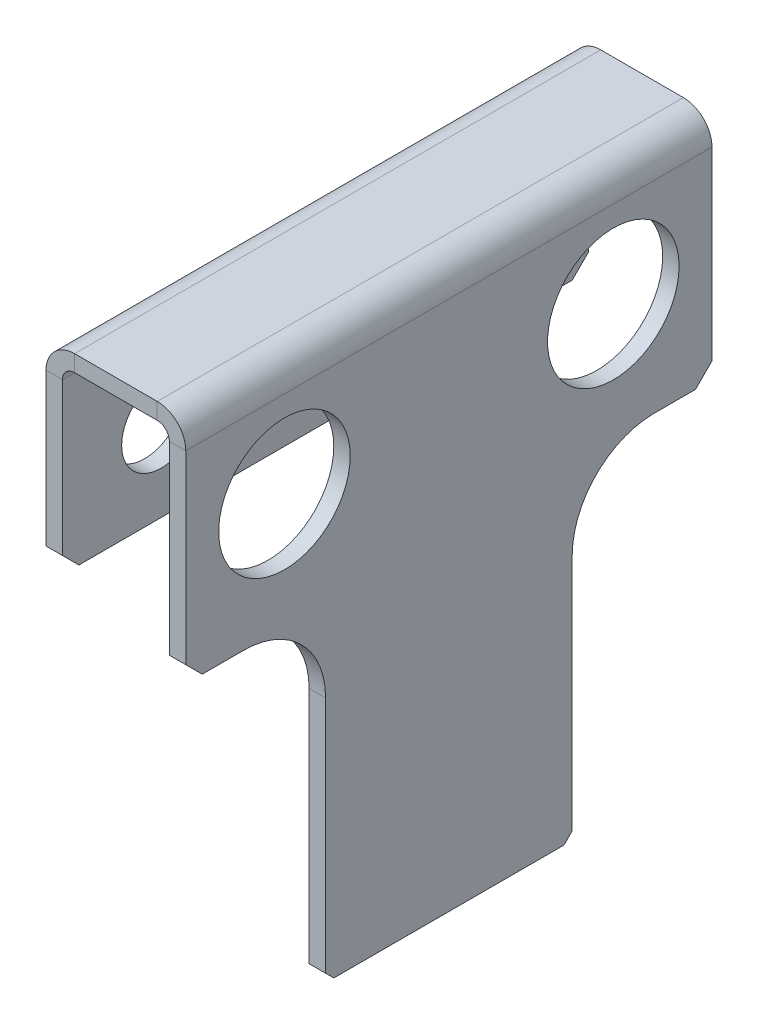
ISO-10303-21;
HEADER;
FILE_DESCRIPTION(('STEP AP214'),'2;1');
FILE_NAME('part.step','',(''),(''),'','','');
FILE_SCHEMA(('AUTOMOTIVE_DESIGN { 1 0 10303 214 1 1 1 1 }'));
ENDSEC;
DATA;
#1=APPLICATION_CONTEXT('core data for automotive mechanical design processes');
#2=APPLICATION_PROTOCOL_DEFINITION('international standard','automotive_design',2000,#1);
#3=PRODUCT_CONTEXT('',#1,'mechanical');
#4=PRODUCT('Part','Part','',(#3));
#5=PRODUCT_RELATED_PRODUCT_CATEGORY('part','',(#4));
#6=PRODUCT_DEFINITION_FORMATION('','',#4);
#7=PRODUCT_DEFINITION_CONTEXT('part definition',#1,'design');
#8=PRODUCT_DEFINITION('design','',#6,#7);
#9=PRODUCT_DEFINITION_SHAPE('','',#8);
#10=(LENGTH_UNIT() NAMED_UNIT(*) SI_UNIT(.MILLI.,.METRE.));
#11=(NAMED_UNIT(*) PLANE_ANGLE_UNIT() SI_UNIT($,.RADIAN.));
#12=(NAMED_UNIT(*) SI_UNIT($,.STERADIAN.) SOLID_ANGLE_UNIT());
#13=UNCERTAINTY_MEASURE_WITH_UNIT(LENGTH_MEASURE(1.E-05),#10,'distance_accuracy_value','');
#14=(GEOMETRIC_REPRESENTATION_CONTEXT(3) GLOBAL_UNCERTAINTY_ASSIGNED_CONTEXT((#13)) GLOBAL_UNIT_ASSIGNED_CONTEXT((#10,
#11,#12)) REPRESENTATION_CONTEXT('',''));
#15=CARTESIAN_POINT('',(0.,0.,0.));
#16=DIRECTION('',(0.,0.,1.));
#17=DIRECTION('',(1.,0.,0.));
#18=AXIS2_PLACEMENT_3D('',#15,#16,#17);
#19=CARTESIAN_POINT('',(1.7366,12.,16.));
#20=DIRECTION('',(0.,0.,1.));
#21=DIRECTION('',(1.,0.,0.));
#22=AXIS2_PLACEMENT_3D('',#19,#20,#21);
#23=PLANE('',#22);
#24=DIRECTION('',(0.,-1.,0.));
#25=VECTOR('',#24,1.);
#26=CARTESIAN_POINT('',(1.7366,12.,16.));
#27=LINE('',#26,#25);
#28=CARTESIAN_POINT('',(1.7366,12.,16.));
#29=VERTEX_POINT('',#28);
#30=CARTESIAN_POINT('',(1.7366,11.,16.));
#31=VERTEX_POINT('',#30);
#32=EDGE_CURVE('E327',#29,#31,#27,.T.);
#33=ORIENTED_EDGE('',*,*,#32,.F.);
#34=CARTESIAN_POINT('',(1.7366,10.2634,16.));
#35=DIRECTION('',(0.,0.,1.));
#36=DIRECTION('',(1.,0.,0.));
#37=AXIS2_PLACEMENT_3D('',#34,#35,#36);
#38=CIRCLE('',#37,1.7366);
#39=CARTESIAN_POINT('',(0.,10.2634,16.));
#40=VERTEX_POINT('',#39);
#41=EDGE_CURVE('E244',#40,#29,#38,.F.);
#42=ORIENTED_EDGE('',*,*,#41,.F.);
#43=DIRECTION('',(-1.,0.,0.));
#44=VECTOR('',#43,1.);
#45=CARTESIAN_POINT('',(1.,10.2634,16.));
#46=LINE('',#45,#44);
#47=CARTESIAN_POINT('',(1.,10.2634,16.));
#48=VERTEX_POINT('',#47);
#49=EDGE_CURVE('E324',#48,#40,#46,.T.);
#50=ORIENTED_EDGE('',*,*,#49,.F.);
#51=CARTESIAN_POINT('',(1.7366,10.2634,16.));
#52=DIRECTION('',(0.,0.,1.));
#53=DIRECTION('',(1.,0.,0.));
#54=AXIS2_PLACEMENT_3D('',#51,#52,#53);
#55=CIRCLE('',#54,0.7366);
#56=EDGE_CURVE('E254',#48,#31,#55,.F.);
#57=ORIENTED_EDGE('',*,*,#56,.T.);
#58=EDGE_LOOP('',(#33,#42,#50,#57));
#59=FACE_BOUND('',#58,.T.);
#60=ADVANCED_FACE('F40',(#59),#23,.T.);
#61=CARTESIAN_POINT('',(1.,10.2634,16.));
#62=DIRECTION('',(0.,0.,1.));
#63=DIRECTION('',(1.,0.,0.));
#64=AXIS2_PLACEMENT_3D('',#61,#62,#63);
#65=PLANE('',#64);
#66=DIRECTION('',(1.,0.,0.));
#67=VECTOR('',#66,1.);
#68=CARTESIAN_POINT('',(0.,12.,16.));
#69=LINE('',#68,#67);
#70=CARTESIAN_POINT('',(6.7634,12.,16.));
#71=VERTEX_POINT('',#70);
#72=EDGE_CURVE('E242',#29,#71,#69,.T.);
#73=ORIENTED_EDGE('',*,*,#72,.F.);
#74=ORIENTED_EDGE('',*,*,#32,.T.);
#75=DIRECTION('',(1.,0.,0.));
#76=VECTOR('',#75,1.);
#77=CARTESIAN_POINT('',(0.,11.,16.));
#78=LINE('',#77,#76);
#79=CARTESIAN_POINT('',(6.7634,11.,16.));
#80=VERTEX_POINT('',#79);
#81=EDGE_CURVE('E257',#31,#80,#78,.T.);
#82=ORIENTED_EDGE('',*,*,#81,.T.);
#83=DIRECTION('',(0.,1.,0.));
#84=VECTOR('',#83,1.);
#85=CARTESIAN_POINT('',(6.7634,11.,16.));
#86=LINE('',#85,#84);
#87=EDGE_CURVE('E215',#80,#71,#86,.T.);
#88=ORIENTED_EDGE('',*,*,#87,.T.);
#89=EDGE_LOOP('',(#73,#74,#82,#88));
#90=FACE_BOUND('',#89,.T.);
#91=ADVANCED_FACE('F432',(#90),#65,.T.);
#92=CARTESIAN_POINT('',(0.,10.2634,-16.));
#93=DIRECTION('',(0.,0.,-1.));
#94=DIRECTION('',(-1.,0.,0.));
#95=AXIS2_PLACEMENT_3D('',#92,#93,#94);
#96=PLANE('',#95);
#97=DIRECTION('',(1.,0.,0.));
#98=VECTOR('',#97,1.);
#99=CARTESIAN_POINT('',(0.,10.2634,-16.));
#100=LINE('',#99,#98);
#101=CARTESIAN_POINT('',(0.,10.2634,-16.));
#102=VERTEX_POINT('',#101);
#103=CARTESIAN_POINT('',(1.,10.2634,-16.));
#104=VERTEX_POINT('',#103);
#105=EDGE_CURVE('E321',#102,#104,#100,.T.);
#106=ORIENTED_EDGE('',*,*,#105,.F.);
#107=CARTESIAN_POINT('',(1.7366,10.2634,-16.));
#108=DIRECTION('',(0.,0.,1.));
#109=DIRECTION('',(1.,0.,0.));
#110=AXIS2_PLACEMENT_3D('',#107,#108,#109);
#111=CIRCLE('',#110,1.7366);
#112=CARTESIAN_POINT('',(1.7366,12.,-16.));
#113=VERTEX_POINT('',#112);
#114=EDGE_CURVE('E272',#102,#113,#111,.F.);
#115=ORIENTED_EDGE('',*,*,#114,.T.);
#116=DIRECTION('',(0.,1.,0.));
#117=VECTOR('',#116,1.);
#118=CARTESIAN_POINT('',(1.7366,11.,-16.));
#119=LINE('',#118,#117);
#120=CARTESIAN_POINT('',(1.7366,11.,-16.));
#121=VERTEX_POINT('',#120);
#122=EDGE_CURVE('E214',#121,#113,#119,.T.);
#123=ORIENTED_EDGE('',*,*,#122,.F.);
#124=CARTESIAN_POINT('',(1.7366,10.2634,-16.));
#125=DIRECTION('',(0.,0.,1.));
#126=DIRECTION('',(1.,0.,0.));
#127=AXIS2_PLACEMENT_3D('',#124,#125,#126);
#128=CIRCLE('',#127,0.7366);
#129=EDGE_CURVE('E279',#104,#121,#128,.F.);
#130=ORIENTED_EDGE('',*,*,#129,.F.);
#131=EDGE_LOOP('',(#106,#115,#123,#130));
#132=FACE_BOUND('',#131,.T.);
#133=ADVANCED_FACE('F527',(#132),#96,.T.);
#134=CARTESIAN_POINT('',(1.7366,11.,-16.));
#135=DIRECTION('',(0.,0.,-1.));
#136=DIRECTION('',(-1.,0.,0.));
#137=AXIS2_PLACEMENT_3D('',#134,#135,#136);
#138=PLANE('',#137);
#139=DIRECTION('',(0.,1.,0.));
#140=VECTOR('',#139,1.);
#141=CARTESIAN_POINT('',(1.,0.,-16.));
#142=LINE('',#141,#140);
#143=CARTESIAN_POINT('',(1.,1.00000000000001,-16.));
#144=VERTEX_POINT('',#143);
#145=EDGE_CURVE('E277',#144,#104,#142,.T.);
#146=ORIENTED_EDGE('',*,*,#145,.F.);
#147=DIRECTION('',(-1.,0.,0.));
#148=VECTOR('',#147,1.);
#149=CARTESIAN_POINT('',(1.7366,1.00000000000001,-16.));
#150=LINE('',#149,#148);
#151=CARTESIAN_POINT('',(0.,1.00000000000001,-16.));
#152=VERTEX_POINT('',#151);
#153=EDGE_CURVE('E385',#144,#152,#150,.T.);
#154=ORIENTED_EDGE('',*,*,#153,.T.);
#155=DIRECTION('',(0.,1.,0.));
#156=VECTOR('',#155,1.);
#157=CARTESIAN_POINT('',(0.,0.,-16.));
#158=LINE('',#157,#156);
#159=EDGE_CURVE('E275',#152,#102,#158,.T.);
#160=ORIENTED_EDGE('',*,*,#159,.T.);
#161=ORIENTED_EDGE('',*,*,#105,.T.);
#162=EDGE_LOOP('',(#146,#154,#160,#161));
#163=FACE_BOUND('',#162,.T.);
#164=ADVANCED_FACE('F405',(#163),#138,.T.);
#165=CARTESIAN_POINT('',(8.5,10.2634,16.));
#166=DIRECTION('',(0.,0.,1.));
#167=DIRECTION('',(1.,0.,0.));
#168=AXIS2_PLACEMENT_3D('',#165,#166,#167);
#169=PLANE('',#168);
#170=DIRECTION('',(-1.,0.,0.));
#171=VECTOR('',#170,1.);
#172=CARTESIAN_POINT('',(8.5,10.2634,16.));
#173=LINE('',#172,#171);
#174=CARTESIAN_POINT('',(8.5,10.2634,16.));
#175=VERTEX_POINT('',#174);
#176=CARTESIAN_POINT('',(7.5,10.2634,16.));
#177=VERTEX_POINT('',#176);
#178=EDGE_CURVE('E202',#175,#177,#173,.T.);
#179=ORIENTED_EDGE('',*,*,#178,.F.);
#180=CARTESIAN_POINT('',(6.7634,10.2634,16.));
#181=DIRECTION('',(0.,0.,1.));
#182=DIRECTION('',(1.,0.,0.));
#183=AXIS2_PLACEMENT_3D('',#180,#181,#182);
#184=CIRCLE('',#183,1.7366);
#185=EDGE_CURVE('E206',#71,#175,#184,.F.);
#186=ORIENTED_EDGE('',*,*,#185,.F.);
#187=ORIENTED_EDGE('',*,*,#87,.F.);
#188=CARTESIAN_POINT('',(6.7634,10.2634,16.));
#189=DIRECTION('',(0.,0.,1.));
#190=DIRECTION('',(1.,0.,0.));
#191=AXIS2_PLACEMENT_3D('',#188,#189,#190);
#192=CIRCLE('',#191,0.7366);
#193=EDGE_CURVE('E209',#80,#177,#192,.F.);
#194=ORIENTED_EDGE('',*,*,#193,.T.);
#195=EDGE_LOOP('',(#179,#186,#187,#194));
#196=FACE_BOUND('',#195,.T.);
#197=ADVANCED_FACE('F204',(#196),#169,.T.);
#198=CARTESIAN_POINT('',(6.7634,11.,16.));
#199=DIRECTION('',(0.,0.,1.));
#200=DIRECTION('',(1.,0.,0.));
#201=AXIS2_PLACEMENT_3D('',#198,#199,#200);
#202=PLANE('',#201);
#203=DIRECTION('',(0.,-1.,0.));
#204=VECTOR('',#203,1.);
#205=CARTESIAN_POINT('',(7.5,12.,16.));
#206=LINE('',#205,#204);
#207=CARTESIAN_POINT('',(7.5,-0.999999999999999,16.));
#208=VERTEX_POINT('',#207);
#209=EDGE_CURVE('E237',#177,#208,#206,.T.);
#210=ORIENTED_EDGE('',*,*,#209,.T.);
#211=DIRECTION('',(1.,0.,0.));
#212=VECTOR('',#211,1.);
#213=CARTESIAN_POINT('',(8.5,-0.999999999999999,16.));
#214=LINE('',#213,#212);
#215=CARTESIAN_POINT('',(8.5,-0.999999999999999,16.));
#216=VERTEX_POINT('',#215);
#217=EDGE_CURVE('E236',#208,#216,#214,.T.);
#218=ORIENTED_EDGE('',*,*,#217,.T.);
#219=DIRECTION('',(0.,-1.,0.));
#220=VECTOR('',#219,1.);
#221=CARTESIAN_POINT('',(8.5,12.,16.));
#222=LINE('',#221,#220);
#223=EDGE_CURVE('E224',#175,#216,#222,.T.);
#224=ORIENTED_EDGE('',*,*,#223,.F.);
#225=ORIENTED_EDGE('',*,*,#178,.T.);
#226=EDGE_LOOP('',(#210,#218,#224,#225));
#227=FACE_BOUND('',#226,.T.);
#228=ADVANCED_FACE('F234',(#227),#202,.T.);
#229=CARTESIAN_POINT('',(6.7634,12.,-16.));
#230=DIRECTION('',(0.,0.,-1.));
#231=DIRECTION('',(-1.,0.,0.));
#232=AXIS2_PLACEMENT_3D('',#229,#230,#231);
#233=PLANE('',#232);
#234=DIRECTION('',(0.,-1.,0.));
#235=VECTOR('',#234,1.);
#236=CARTESIAN_POINT('',(6.7634,12.,-16.));
#237=LINE('',#236,#235);
#238=CARTESIAN_POINT('',(6.7634,12.,-16.));
#239=VERTEX_POINT('',#238);
#240=CARTESIAN_POINT('',(6.7634,11.,-16.));
#241=VERTEX_POINT('',#240);
#242=EDGE_CURVE('E317',#239,#241,#237,.T.);
#243=ORIENTED_EDGE('',*,*,#242,.F.);
#244=CARTESIAN_POINT('',(6.7634,10.2634,-16.));
#245=DIRECTION('',(0.,0.,1.));
#246=DIRECTION('',(1.,0.,0.));
#247=AXIS2_PLACEMENT_3D('',#244,#245,#246);
#248=CIRCLE('',#247,1.7366);
#249=CARTESIAN_POINT('',(8.5,10.2634,-16.));
#250=VERTEX_POINT('',#249);
#251=EDGE_CURVE('E267',#239,#250,#248,.F.);
#252=ORIENTED_EDGE('',*,*,#251,.T.);
#253=DIRECTION('',(1.,0.,0.));
#254=VECTOR('',#253,1.);
#255=CARTESIAN_POINT('',(7.5,10.2634,-16.));
#256=LINE('',#255,#254);
#257=CARTESIAN_POINT('',(7.5,10.2634,-16.));
#258=VERTEX_POINT('',#257);
#259=EDGE_CURVE('E315',#258,#250,#256,.T.);
#260=ORIENTED_EDGE('',*,*,#259,.F.);
#261=CARTESIAN_POINT('',(6.7634,10.2634,-16.));
#262=DIRECTION('',(0.,0.,1.));
#263=DIRECTION('',(1.,0.,0.));
#264=AXIS2_PLACEMENT_3D('',#261,#262,#263);
#265=CIRCLE('',#264,0.7366);
#266=EDGE_CURVE('E285',#241,#258,#265,.F.);
#267=ORIENTED_EDGE('',*,*,#266,.F.);
#268=EDGE_LOOP('',(#243,#252,#260,#267));
#269=FACE_BOUND('',#268,.T.);
#270=ADVANCED_FACE('F519',(#269),#233,.T.);
#271=CARTESIAN_POINT('',(7.5,10.2634,-16.));
#272=DIRECTION('',(0.,0.,-1.));
#273=DIRECTION('',(-1.,0.,0.));
#274=AXIS2_PLACEMENT_3D('',#271,#272,#273);
#275=PLANE('',#274);
#276=DIRECTION('',(1.,0.,0.));
#277=VECTOR('',#276,1.);
#278=CARTESIAN_POINT('',(0.,12.,-16.));
#279=LINE('',#278,#277);
#280=EDGE_CURVE('E269',#113,#239,#279,.T.);
#281=ORIENTED_EDGE('',*,*,#280,.T.);
#282=ORIENTED_EDGE('',*,*,#242,.T.);
#283=DIRECTION('',(1.,0.,0.));
#284=VECTOR('',#283,1.);
#285=CARTESIAN_POINT('',(0.,11.,-16.));
#286=LINE('',#285,#284);
#287=EDGE_CURVE('E282',#121,#241,#286,.T.);
#288=ORIENTED_EDGE('',*,*,#287,.F.);
#289=ORIENTED_EDGE('',*,*,#122,.T.);
#290=EDGE_LOOP('',(#281,#282,#288,#289));
#291=FACE_BOUND('',#290,.T.);
#292=ADVANCED_FACE('F510',(#291),#275,.T.);
#293=CARTESIAN_POINT('',(7.5,12.,16.));
#294=DIRECTION('',(1.,0.,0.));
#295=DIRECTION('',(0.,1.,0.));
#296=AXIS2_PLACEMENT_3D('',#293,#294,#295);
#297=PLANE('',#296);
#298=CARTESIAN_POINT('',(7.5,5.,10.));
#299=DIRECTION('',(1.,0.,0.));
#300=DIRECTION('',(0.,1.,0.));
#301=AXIS2_PLACEMENT_3D('',#298,#299,#300);
#302=CIRCLE('',#301,3.99999999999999);
#303=CARTESIAN_POINT('',(7.5,9.,10.));
#304=VERTEX_POINT('',#303);
#305=EDGE_CURVE('E479',#304,#304,#302,.T.);
#306=ORIENTED_EDGE('',*,*,#305,.T.);
#307=EDGE_LOOP('',(#306));
#308=FACE_BOUND('',#307,.T.);
#309=CARTESIAN_POINT('',(7.5,5.,-10.));
#310=DIRECTION('',(1.,0.,0.));
#311=DIRECTION('',(0.,1.,0.));
#312=AXIS2_PLACEMENT_3D('',#309,#310,#311);
#313=CIRCLE('',#312,3.99999999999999);
#314=CARTESIAN_POINT('',(7.5,9.,-10.));
#315=VERTEX_POINT('',#314);
#316=EDGE_CURVE('E470',#315,#315,#313,.T.);
#317=ORIENTED_EDGE('',*,*,#316,.T.);
#318=EDGE_LOOP('',(#317));
#319=FACE_BOUND('',#318,.T.);
#320=DIRECTION('',(0.,0.,-1.));
#321=VECTOR('',#320,1.);
#322=CARTESIAN_POINT('',(7.50000000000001,-22.,16.));
#323=LINE('',#322,#321);
#324=CARTESIAN_POINT('',(7.50000000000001,-22.,6.99999999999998));
#325=VERTEX_POINT('',#324);
#326=CARTESIAN_POINT('',(7.50000000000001,-22.,-6.99999999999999));
#327=VERTEX_POINT('',#326);
#328=EDGE_CURVE('E312',#325,#327,#323,.T.);
#329=ORIENTED_EDGE('',*,*,#328,.F.);
#330=DIRECTION('',(0.,0.707106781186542,0.707106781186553));
#331=VECTOR('',#330,1.);
#332=CARTESIAN_POINT('',(7.50000000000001,-21.5,7.5));
#333=LINE('',#332,#331);
#334=CARTESIAN_POINT('',(7.50000000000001,-21.5,7.5));
#335=VERTEX_POINT('',#334);
#336=EDGE_CURVE('E381',#325,#335,#333,.T.);
#337=ORIENTED_EDGE('',*,*,#336,.T.);
#338=DIRECTION('',(0.,1.,0.));
#339=VECTOR('',#338,1.);
#340=CARTESIAN_POINT('',(7.5,12.,7.49999999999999));
#341=LINE('',#340,#339);
#342=CARTESIAN_POINT('',(7.5,-7.,7.5));
#343=VERTEX_POINT('',#342);
#344=EDGE_CURVE('E450',#335,#343,#341,.T.);
#345=ORIENTED_EDGE('',*,*,#344,.T.);
#346=CARTESIAN_POINT('',(7.5,-7.,12.5));
#347=DIRECTION('',(1.,0.,0.));
#348=DIRECTION('',(0.,1.,0.));
#349=AXIS2_PLACEMENT_3D('',#346,#347,#348);
#350=CIRCLE('',#349,5.);
#351=CARTESIAN_POINT('',(7.5,-2.,12.5));
#352=VERTEX_POINT('',#351);
#353=EDGE_CURVE('E349',#343,#352,#350,.T.);
#354=ORIENTED_EDGE('',*,*,#353,.T.);
#355=DIRECTION('',(0.,0.,1.));
#356=VECTOR('',#355,1.);
#357=CARTESIAN_POINT('',(7.5,-2.,16.));
#358=LINE('',#357,#356);
#359=CARTESIAN_POINT('',(7.5,-2.,15.));
#360=VERTEX_POINT('',#359);
#361=EDGE_CURVE('E265',#352,#360,#358,.T.);
#362=ORIENTED_EDGE('',*,*,#361,.T.);
#363=DIRECTION('',(0.,0.707106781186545,0.70710678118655));
#364=VECTOR('',#363,1.);
#365=CARTESIAN_POINT('',(7.5,-0.999999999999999,16.));
#366=LINE('',#365,#364);
#367=EDGE_CURVE('E354',#360,#208,#366,.T.);
#368=ORIENTED_EDGE('',*,*,#367,.T.);
#369=ORIENTED_EDGE('',*,*,#209,.F.);
#370=DIRECTION('',(0.,0.,-1.));
#371=VECTOR('',#370,1.);
#372=CARTESIAN_POINT('',(7.5,10.2634,16.));
#373=LINE('',#372,#371);
#374=EDGE_CURVE('E261',#177,#258,#373,.T.);
#375=ORIENTED_EDGE('',*,*,#374,.T.);
#376=DIRECTION('',(0.,-1.,0.));
#377=VECTOR('',#376,1.);
#378=CARTESIAN_POINT('',(7.5,12.,-16.));
#379=LINE('',#378,#377);
#380=CARTESIAN_POINT('',(7.5,-0.999999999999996,-16.));
#381=VERTEX_POINT('',#380);
#382=EDGE_CURVE('E262',#258,#381,#379,.T.);
#383=ORIENTED_EDGE('',*,*,#382,.T.);
#384=DIRECTION('',(0.,0.707106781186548,-0.707106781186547));
#385=VECTOR('',#384,1.);
#386=CARTESIAN_POINT('',(7.5,-0.999999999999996,-16.));
#387=LINE('',#386,#385);
#388=CARTESIAN_POINT('',(7.5,-2.,-15.));
#389=VERTEX_POINT('',#388);
#390=EDGE_CURVE('E356',#381,#389,#387,.F.);
#391=ORIENTED_EDGE('',*,*,#390,.T.);
#392=DIRECTION('',(0.,0.,1.));
#393=VECTOR('',#392,1.);
#394=CARTESIAN_POINT('',(7.5,-1.99999999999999,16.));
#395=LINE('',#394,#393);
#396=CARTESIAN_POINT('',(7.5,-2.,-12.5));
#397=VERTEX_POINT('',#396);
#398=EDGE_CURVE('E460',#389,#397,#395,.T.);
#399=ORIENTED_EDGE('',*,*,#398,.T.);
#400=CARTESIAN_POINT('',(7.5,-7.,-12.5));
#401=DIRECTION('',(1.,0.,0.));
#402=DIRECTION('',(0.,1.,0.));
#403=AXIS2_PLACEMENT_3D('',#400,#401,#402);
#404=CIRCLE('',#403,5.);
#405=CARTESIAN_POINT('',(7.5,-7.,-7.5));
#406=VERTEX_POINT('',#405);
#407=EDGE_CURVE('E344',#397,#406,#404,.T.);
#408=ORIENTED_EDGE('',*,*,#407,.T.);
#409=DIRECTION('',(0.,-1.,0.));
#410=VECTOR('',#409,1.);
#411=CARTESIAN_POINT('',(7.5,12.,-7.49999999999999));
#412=LINE('',#411,#410);
#413=CARTESIAN_POINT('',(7.50000000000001,-21.5,-7.5));
#414=VERTEX_POINT('',#413);
#415=EDGE_CURVE('E457',#406,#414,#412,.T.);
#416=ORIENTED_EDGE('',*,*,#415,.T.);
#417=DIRECTION('',(0.,-0.707106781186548,0.707106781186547));
#418=VECTOR('',#417,1.);
#419=CARTESIAN_POINT('',(7.50000000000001,-22.,-6.99999999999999));
#420=LINE('',#419,#418);
#421=EDGE_CURVE('E379',#414,#327,#420,.T.);
#422=ORIENTED_EDGE('',*,*,#421,.T.);
#423=EDGE_LOOP('',(#329,#337,#345,#354,#362,#368,#369,#375,#383,#391,#399,#408,#416,#422));
#424=FACE_BOUND('',#423,.T.);
#425=ADVANCED_FACE('F445',(#308,#319,#424),#297,.F.);
#426=CARTESIAN_POINT('',(8.50000000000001,-22.,16.));
#427=DIRECTION('',(0.,-1.,0.));
#428=DIRECTION('',(0.,0.,-1.));
#429=AXIS2_PLACEMENT_3D('',#426,#427,#428);
#430=PLANE('',#429);
#431=DIRECTION('',(0.,0.,-1.));
#432=VECTOR('',#431,1.);
#433=CARTESIAN_POINT('',(8.50000000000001,-22.,16.));
#434=LINE('',#433,#432);
#435=CARTESIAN_POINT('',(8.50000000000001,-22.,6.99999999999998));
#436=VERTEX_POINT('',#435);
#437=CARTESIAN_POINT('',(8.50000000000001,-22.,-6.99999999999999));
#438=VERTEX_POINT('',#437);
#439=EDGE_CURVE('E230',#436,#438,#434,.T.);
#440=ORIENTED_EDGE('',*,*,#439,.F.);
#441=DIRECTION('',(-1.,0.,0.));
#442=VECTOR('',#441,1.);
#443=CARTESIAN_POINT('',(7.50000000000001,-22.,6.99999999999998));
#444=LINE('',#443,#442);
#445=EDGE_CURVE('E377',#436,#325,#444,.T.);
#446=ORIENTED_EDGE('',*,*,#445,.T.);
#447=ORIENTED_EDGE('',*,*,#328,.T.);
#448=DIRECTION('',(1.,0.,0.));
#449=VECTOR('',#448,1.);
#450=CARTESIAN_POINT('',(8.5,-22.,-6.99999999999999));
#451=LINE('',#450,#449);
#452=EDGE_CURVE('E374',#327,#438,#451,.T.);
#453=ORIENTED_EDGE('',*,*,#452,.T.);
#454=EDGE_LOOP('',(#440,#446,#447,#453));
#455=FACE_BOUND('',#454,.T.);
#456=ADVANCED_FACE('F497',(#455),#430,.T.);
#457=CARTESIAN_POINT('',(8.5,12.,16.));
#458=DIRECTION('',(1.,0.,0.));
#459=DIRECTION('',(0.,1.,0.));
#460=AXIS2_PLACEMENT_3D('',#457,#458,#459);
#461=PLANE('',#460);
#462=CARTESIAN_POINT('',(8.5,5.,10.));
#463=DIRECTION('',(1.,0.,0.));
#464=DIRECTION('',(0.,0.,-1.));
#465=AXIS2_PLACEMENT_3D('',#462,#463,#464);
#466=CIRCLE('',#465,3.99999999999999);
#467=CARTESIAN_POINT('',(8.5,5.,6.00000000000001));
#468=VERTEX_POINT('',#467);
#469=EDGE_CURVE('E488',#468,#468,#466,.T.);
#470=ORIENTED_EDGE('',*,*,#469,.F.);
#471=EDGE_LOOP('',(#470));
#472=FACE_BOUND('',#471,.T.);
#473=CARTESIAN_POINT('',(8.5,5.,-10.));
#474=DIRECTION('',(1.,0.,0.));
#475=DIRECTION('',(0.,0.,-1.));
#476=AXIS2_PLACEMENT_3D('',#473,#474,#475);
#477=CIRCLE('',#476,3.99999999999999);
#478=CARTESIAN_POINT('',(8.5,5.,-14.));
#479=VERTEX_POINT('',#478);
#480=EDGE_CURVE('E476',#479,#479,#477,.T.);
#481=ORIENTED_EDGE('',*,*,#480,.F.);
#482=EDGE_LOOP('',(#481));
#483=FACE_BOUND('',#482,.T.);
#484=DIRECTION('',(0.,1.,0.));
#485=VECTOR('',#484,1.);
#486=CARTESIAN_POINT('',(8.5,-22.,7.5));
#487=LINE('',#486,#485);
#488=CARTESIAN_POINT('',(8.5,-21.5,7.5));
#489=VERTEX_POINT('',#488);
#490=CARTESIAN_POINT('',(8.5,-7.,7.5));
#491=VERTEX_POINT('',#490);
#492=EDGE_CURVE('E455',#489,#491,#487,.T.);
#493=ORIENTED_EDGE('',*,*,#492,.F.);
#494=DIRECTION('',(0.,-0.707106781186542,-0.707106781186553));
#495=VECTOR('',#494,1.);
#496=CARTESIAN_POINT('',(8.5,-0.500000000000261,28.5000000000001));
#497=LINE('',#496,#495);
#498=EDGE_CURVE('E372',#489,#436,#497,.T.);
#499=ORIENTED_EDGE('',*,*,#498,.T.);
#500=ORIENTED_EDGE('',*,*,#439,.T.);
#501=DIRECTION('',(0.,0.707106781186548,-0.707106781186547));
#502=VECTOR('',#501,1.);
#503=CARTESIAN_POINT('',(8.50000000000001,-16.5,-12.5));
#504=LINE('',#503,#502);
#505=CARTESIAN_POINT('',(8.5,-21.5,-7.5));
#506=VERTEX_POINT('',#505);
#507=EDGE_CURVE('E370',#438,#506,#504,.T.);
#508=ORIENTED_EDGE('',*,*,#507,.T.);
#509=DIRECTION('',(0.,-1.,0.));
#510=VECTOR('',#509,1.);
#511=CARTESIAN_POINT('',(8.5,-22.,-7.5));
#512=LINE('',#511,#510);
#513=CARTESIAN_POINT('',(8.5,-7.,-7.5));
#514=VERTEX_POINT('',#513);
#515=EDGE_CURVE('E462',#514,#506,#512,.T.);
#516=ORIENTED_EDGE('',*,*,#515,.F.);
#517=CARTESIAN_POINT('',(8.5,-7.,-12.5));
#518=DIRECTION('',(1.,0.,0.));
#519=DIRECTION('',(0.,1.,0.));
#520=AXIS2_PLACEMENT_3D('',#517,#518,#519);
#521=CIRCLE('',#520,5.);
#522=CARTESIAN_POINT('',(8.5,-2.,-12.5));
#523=VERTEX_POINT('',#522);
#524=EDGE_CURVE('E341',#514,#523,#521,.F.);
#525=ORIENTED_EDGE('',*,*,#524,.T.);
#526=DIRECTION('',(0.,0.,1.));
#527=VECTOR('',#526,1.);
#528=CARTESIAN_POINT('',(8.5,-2.,-16.));
#529=LINE('',#528,#527);
#530=CARTESIAN_POINT('',(8.5,-2.,-15.));
#531=VERTEX_POINT('',#530);
#532=EDGE_CURVE('E465',#531,#523,#529,.T.);
#533=ORIENTED_EDGE('',*,*,#532,.F.);
#534=DIRECTION('',(0.,-0.707106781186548,0.707106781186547));
#535=VECTOR('',#534,1.);
#536=CARTESIAN_POINT('',(8.5,-10.5,-6.50000000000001));
#537=LINE('',#536,#535);
#538=CARTESIAN_POINT('',(8.5,-0.999999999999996,-16.));
#539=VERTEX_POINT('',#538);
#540=EDGE_CURVE('E362',#531,#539,#537,.F.);
#541=ORIENTED_EDGE('',*,*,#540,.T.);
#542=DIRECTION('',(0.,-1.,0.));
#543=VECTOR('',#542,1.);
#544=CARTESIAN_POINT('',(8.5,12.,-16.));
#545=LINE('',#544,#543);
#546=EDGE_CURVE('E226',#250,#539,#545,.T.);
#547=ORIENTED_EDGE('',*,*,#546,.F.);
#548=DIRECTION('',(0.,0.,-1.));
#549=VECTOR('',#548,1.);
#550=CARTESIAN_POINT('',(8.5,10.2634,16.));
#551=LINE('',#550,#549);
#552=EDGE_CURVE('E221',#175,#250,#551,.T.);
#553=ORIENTED_EDGE('',*,*,#552,.F.);
#554=ORIENTED_EDGE('',*,*,#223,.T.);
#555=DIRECTION('',(0.,-0.707106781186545,-0.70710678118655));
#556=VECTOR('',#555,1.);
#557=CARTESIAN_POINT('',(8.5,5.49999999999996,22.5));
#558=LINE('',#557,#556);
#559=CARTESIAN_POINT('',(8.5,-2.,15.));
#560=VERTEX_POINT('',#559);
#561=EDGE_CURVE('E360',#216,#560,#558,.T.);
#562=ORIENTED_EDGE('',*,*,#561,.T.);
#563=DIRECTION('',(0.,0.,1.));
#564=VECTOR('',#563,1.);
#565=CARTESIAN_POINT('',(8.5,-2.,16.));
#566=LINE('',#565,#564);
#567=CARTESIAN_POINT('',(8.5,-2.,12.5));
#568=VERTEX_POINT('',#567);
#569=EDGE_CURVE('E452',#568,#560,#566,.T.);
#570=ORIENTED_EDGE('',*,*,#569,.F.);
#571=CARTESIAN_POINT('',(8.5,-7.,12.5));
#572=DIRECTION('',(1.,0.,0.));
#573=DIRECTION('',(0.,1.,0.));
#574=AXIS2_PLACEMENT_3D('',#571,#572,#573);
#575=CIRCLE('',#574,5.);
#576=EDGE_CURVE('E346',#568,#491,#575,.F.);
#577=ORIENTED_EDGE('',*,*,#576,.T.);
#578=EDGE_LOOP('',(#493,#499,#500,#508,#516,#525,#533,#541,#547,#553,#554,#562,#570,#577));
#579=FACE_BOUND('',#578,.T.);
#580=ADVANCED_FACE('F223',(#472,#483,#579),#461,.T.);
#581=CARTESIAN_POINT('',(6.7634,10.2634,16.));
#582=DIRECTION('',(0.,0.,-1.));
#583=DIRECTION('',(-1.,0.,0.));
#584=AXIS2_PLACEMENT_3D('',#581,#582,#583);
#585=CYLINDRICAL_SURFACE('',#584,1.7366);
#586=ORIENTED_EDGE('',*,*,#251,.F.);
#587=DIRECTION('',(0.,0.,-1.));
#588=VECTOR('',#587,1.);
#589=CARTESIAN_POINT('',(6.7634,12.,16.));
#590=LINE('',#589,#588);
#591=EDGE_CURVE('E231',#71,#239,#590,.T.);
#592=ORIENTED_EDGE('',*,*,#591,.F.);
#593=ORIENTED_EDGE('',*,*,#185,.T.);
#594=ORIENTED_EDGE('',*,*,#552,.T.);
#595=EDGE_LOOP('',(#586,#592,#593,#594));
#596=FACE_BOUND('',#595,.T.);
#597=ADVANCED_FACE('F240',(#596),#585,.T.);
#598=CARTESIAN_POINT('',(0.,12.,16.));
#599=DIRECTION('',(0.,1.,0.));
#600=DIRECTION('',(0.,0.,1.));
#601=AXIS2_PLACEMENT_3D('',#598,#599,#600);
#602=PLANE('',#601);
#603=ORIENTED_EDGE('',*,*,#280,.F.);
#604=DIRECTION('',(0.,0.,-1.));
#605=VECTOR('',#604,1.);
#606=CARTESIAN_POINT('',(1.7366,12.,16.));
#607=LINE('',#606,#605);
#608=EDGE_CURVE('E306',#29,#113,#607,.T.);
#609=ORIENTED_EDGE('',*,*,#608,.F.);
#610=ORIENTED_EDGE('',*,*,#72,.T.);
#611=ORIENTED_EDGE('',*,*,#591,.T.);
#612=EDGE_LOOP('',(#603,#609,#610,#611));
#613=FACE_BOUND('',#612,.T.);
#614=ADVANCED_FACE('F431',(#613),#602,.T.);
#615=CARTESIAN_POINT('',(1.7366,10.2634,16.));
#616=DIRECTION('',(0.,0.,-1.));
#617=DIRECTION('',(-1.,0.,0.));
#618=AXIS2_PLACEMENT_3D('',#615,#616,#617);
#619=CYLINDRICAL_SURFACE('',#618,1.7366);
#620=ORIENTED_EDGE('',*,*,#114,.F.);
#621=DIRECTION('',(0.,0.,-1.));
#622=VECTOR('',#621,1.);
#623=CARTESIAN_POINT('',(0.,10.2634,16.));
#624=LINE('',#623,#622);
#625=EDGE_CURVE('E303',#40,#102,#624,.T.);
#626=ORIENTED_EDGE('',*,*,#625,.F.);
#627=ORIENTED_EDGE('',*,*,#41,.T.);
#628=ORIENTED_EDGE('',*,*,#608,.T.);
#629=EDGE_LOOP('',(#620,#626,#627,#628));
#630=FACE_BOUND('',#629,.T.);
#631=ADVANCED_FACE('F423',(#630),#619,.T.);
#632=CARTESIAN_POINT('',(0.,0.,16.));
#633=DIRECTION('',(-1.,0.,0.));
#634=DIRECTION('',(0.,0.,1.));
#635=AXIS2_PLACEMENT_3D('',#632,#633,#634);
#636=PLANE('',#635);
#637=CARTESIAN_POINT('',(0.,5.,10.));
#638=DIRECTION('',(1.,0.,0.));
#639=DIRECTION('',(0.,0.,-1.));
#640=AXIS2_PLACEMENT_3D('',#637,#638,#639);
#641=CIRCLE('',#640,2.4);
#642=CARTESIAN_POINT('',(0.,5.,7.6));
#643=VERTEX_POINT('',#642);
#644=EDGE_CURVE('E485',#643,#643,#641,.T.);
#645=ORIENTED_EDGE('',*,*,#644,.T.);
#646=EDGE_LOOP('',(#645));
#647=FACE_BOUND('',#646,.T.);
#648=CARTESIAN_POINT('',(0.,5.,-10.));
#649=DIRECTION('',(1.,0.,0.));
#650=DIRECTION('',(0.,0.,-1.));
#651=AXIS2_PLACEMENT_3D('',#648,#649,#650);
#652=CIRCLE('',#651,2.4);
#653=CARTESIAN_POINT('',(0.,5.,-12.4));
#654=VERTEX_POINT('',#653);
#655=EDGE_CURVE('E473',#654,#654,#652,.T.);
#656=ORIENTED_EDGE('',*,*,#655,.T.);
#657=EDGE_LOOP('',(#656));
#658=FACE_BOUND('',#657,.T.);
#659=ORIENTED_EDGE('',*,*,#159,.F.);
#660=DIRECTION('',(0.,0.707106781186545,-0.70710678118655));
#661=VECTOR('',#660,1.);
#662=CARTESIAN_POINT('',(0.,-15.5,0.500000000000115));
#663=LINE('',#662,#661);
#664=CARTESIAN_POINT('',(0.,0.,-15.));
#665=VERTEX_POINT('',#664);
#666=EDGE_CURVE('E390',#152,#665,#663,.F.);
#667=ORIENTED_EDGE('',*,*,#666,.T.);
#668=DIRECTION('',(0.,0.,-1.));
#669=VECTOR('',#668,1.);
#670=CARTESIAN_POINT('',(0.,0.,16.));
#671=LINE('',#670,#669);
#672=CARTESIAN_POINT('',(0.,0.,15.));
#673=VERTEX_POINT('',#672);
#674=EDGE_CURVE('E301',#673,#665,#671,.T.);
#675=ORIENTED_EDGE('',*,*,#674,.F.);
#676=DIRECTION('',(0.,-0.707106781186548,-0.707106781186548));
#677=VECTOR('',#676,1.);
#678=CARTESIAN_POINT('',(0.,0.5,15.5));
#679=LINE('',#678,#677);
#680=CARTESIAN_POINT('',(0.,1.,16.));
#681=VERTEX_POINT('',#680);
#682=EDGE_CURVE('E388',#673,#681,#679,.F.);
#683=ORIENTED_EDGE('',*,*,#682,.T.);
#684=DIRECTION('',(0.,1.,0.));
#685=VECTOR('',#684,1.);
#686=CARTESIAN_POINT('',(0.,0.,16.));
#687=LINE('',#686,#685);
#688=EDGE_CURVE('E250',#681,#40,#687,.T.);
#689=ORIENTED_EDGE('',*,*,#688,.T.);
#690=ORIENTED_EDGE('',*,*,#625,.T.);
#691=EDGE_LOOP('',(#659,#667,#675,#683,#689,#690));
#692=FACE_BOUND('',#691,.T.);
#693=ADVANCED_FACE('F411',(#647,#658,#692),#636,.T.);
#694=CARTESIAN_POINT('',(1.,0.,16.));
#695=DIRECTION('',(0.,-1.,0.));
#696=DIRECTION('',(0.,0.,-1.));
#697=AXIS2_PLACEMENT_3D('',#694,#695,#696);
#698=PLANE('',#697);
#699=ORIENTED_EDGE('',*,*,#674,.T.);
#700=DIRECTION('',(1.,0.,0.));
#701=VECTOR('',#700,1.);
#702=CARTESIAN_POINT('',(1.,0.,-15.));
#703=LINE('',#702,#701);
#704=CARTESIAN_POINT('',(1.,0.,-15.));
#705=VERTEX_POINT('',#704);
#706=EDGE_CURVE('E61',#665,#705,#703,.T.);
#707=ORIENTED_EDGE('',*,*,#706,.T.);
#708=DIRECTION('',(0.,0.,-1.));
#709=VECTOR('',#708,1.);
#710=CARTESIAN_POINT('',(1.,0.,16.));
#711=LINE('',#710,#709);
#712=CARTESIAN_POINT('',(1.,0.,15.));
#713=VERTEX_POINT('',#712);
#714=EDGE_CURVE('E299',#713,#705,#711,.T.);
#715=ORIENTED_EDGE('',*,*,#714,.F.);
#716=DIRECTION('',(-1.,0.,0.));
#717=VECTOR('',#716,1.);
#718=CARTESIAN_POINT('',(1.,0.,15.));
#719=LINE('',#718,#717);
#720=EDGE_CURVE('E392',#713,#673,#719,.T.);
#721=ORIENTED_EDGE('',*,*,#720,.T.);
#722=EDGE_LOOP('',(#699,#707,#715,#721));
#723=FACE_BOUND('',#722,.T.);
#724=ADVANCED_FACE('F412',(#723),#698,.T.);
#725=CARTESIAN_POINT('',(1.,0.,16.));
#726=DIRECTION('',(-1.,0.,0.));
#727=DIRECTION('',(0.,0.,1.));
#728=AXIS2_PLACEMENT_3D('',#725,#726,#727);
#729=PLANE('',#728);
#730=CARTESIAN_POINT('',(1.,5.,10.));
#731=DIRECTION('',(-1.,0.,0.));
#732=DIRECTION('',(0.,0.,1.));
#733=AXIS2_PLACEMENT_3D('',#730,#731,#732);
#734=CIRCLE('',#733,2.4);
#735=CARTESIAN_POINT('',(1.,5.,12.4));
#736=VERTEX_POINT('',#735);
#737=EDGE_CURVE('E482',#736,#736,#734,.T.);
#738=ORIENTED_EDGE('',*,*,#737,.T.);
#739=EDGE_LOOP('',(#738));
#740=FACE_BOUND('',#739,.T.);
#741=CARTESIAN_POINT('',(1.,5.,-10.));
#742=DIRECTION('',(-1.,0.,0.));
#743=DIRECTION('',(0.,0.,1.));
#744=AXIS2_PLACEMENT_3D('',#741,#742,#743);
#745=CIRCLE('',#744,2.4);
#746=CARTESIAN_POINT('',(1.,5.,-7.6));
#747=VERTEX_POINT('',#746);
#748=EDGE_CURVE('E467',#747,#747,#745,.T.);
#749=ORIENTED_EDGE('',*,*,#748,.T.);
#750=EDGE_LOOP('',(#749));
#751=FACE_BOUND('',#750,.T.);
#752=ORIENTED_EDGE('',*,*,#714,.T.);
#753=DIRECTION('',(0.,-0.707106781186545,0.70710678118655));
#754=VECTOR('',#753,1.);
#755=CARTESIAN_POINT('',(1.,1.00000000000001,-16.));
#756=LINE('',#755,#754);
#757=EDGE_CURVE('E48',#705,#144,#756,.F.);
#758=ORIENTED_EDGE('',*,*,#757,.T.);
#759=ORIENTED_EDGE('',*,*,#145,.T.);
#760=DIRECTION('',(0.,0.,-1.));
#761=VECTOR('',#760,1.);
#762=CARTESIAN_POINT('',(1.,10.2634,16.));
#763=LINE('',#762,#761);
#764=EDGE_CURVE('E296',#48,#104,#763,.T.);
#765=ORIENTED_EDGE('',*,*,#764,.F.);
#766=DIRECTION('',(0.,1.,0.));
#767=VECTOR('',#766,1.);
#768=CARTESIAN_POINT('',(1.,0.,16.));
#769=LINE('',#768,#767);
#770=CARTESIAN_POINT('',(1.,1.,16.));
#771=VERTEX_POINT('',#770);
#772=EDGE_CURVE('E252',#771,#48,#769,.T.);
#773=ORIENTED_EDGE('',*,*,#772,.F.);
#774=DIRECTION('',(0.,0.707106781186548,0.707106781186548));
#775=VECTOR('',#774,1.);
#776=CARTESIAN_POINT('',(1.,0.,15.));
#777=LINE('',#776,#775);
#778=EDGE_CURVE('E396',#771,#713,#777,.F.);
#779=ORIENTED_EDGE('',*,*,#778,.T.);
#780=EDGE_LOOP('',(#752,#758,#759,#765,#773,#779));
#781=FACE_BOUND('',#780,.T.);
#782=ADVANCED_FACE('F400',(#740,#751,#781),#729,.F.);
#783=CARTESIAN_POINT('',(1.7366,10.2634,16.));
#784=DIRECTION('',(0.,0.,-1.));
#785=DIRECTION('',(-1.,0.,0.));
#786=AXIS2_PLACEMENT_3D('',#783,#784,#785);
#787=CYLINDRICAL_SURFACE('',#786,0.7366);
#788=ORIENTED_EDGE('',*,*,#129,.T.);
#789=DIRECTION('',(0.,0.,-1.));
#790=VECTOR('',#789,1.);
#791=CARTESIAN_POINT('',(1.7366,11.,16.));
#792=LINE('',#791,#790);
#793=EDGE_CURVE('E293',#31,#121,#792,.T.);
#794=ORIENTED_EDGE('',*,*,#793,.F.);
#795=ORIENTED_EDGE('',*,*,#56,.F.);
#796=ORIENTED_EDGE('',*,*,#764,.T.);
#797=EDGE_LOOP('',(#788,#794,#795,#796));
#798=FACE_BOUND('',#797,.T.);
#799=ADVANCED_FACE('F595',(#798),#787,.F.);
#800=CARTESIAN_POINT('',(0.,11.,16.));
#801=DIRECTION('',(0.,1.,0.));
#802=DIRECTION('',(0.,0.,1.));
#803=AXIS2_PLACEMENT_3D('',#800,#801,#802);
#804=PLANE('',#803);
#805=ORIENTED_EDGE('',*,*,#287,.T.);
#806=DIRECTION('',(0.,0.,-1.));
#807=VECTOR('',#806,1.);
#808=CARTESIAN_POINT('',(6.7634,11.,16.));
#809=LINE('',#808,#807);
#810=EDGE_CURVE('E290',#80,#241,#809,.T.);
#811=ORIENTED_EDGE('',*,*,#810,.F.);
#812=ORIENTED_EDGE('',*,*,#81,.F.);
#813=ORIENTED_EDGE('',*,*,#793,.T.);
#814=EDGE_LOOP('',(#805,#811,#812,#813));
#815=FACE_BOUND('',#814,.T.);
#816=ADVANCED_FACE('F436',(#815),#804,.F.);
#817=CARTESIAN_POINT('',(6.7634,10.2634,16.));
#818=DIRECTION('',(0.,0.,-1.));
#819=DIRECTION('',(-1.,0.,0.));
#820=AXIS2_PLACEMENT_3D('',#817,#818,#819);
#821=CYLINDRICAL_SURFACE('',#820,0.7366);
#822=ORIENTED_EDGE('',*,*,#266,.T.);
#823=ORIENTED_EDGE('',*,*,#374,.F.);
#824=ORIENTED_EDGE('',*,*,#193,.F.);
#825=ORIENTED_EDGE('',*,*,#810,.T.);
#826=EDGE_LOOP('',(#822,#823,#824,#825));
#827=FACE_BOUND('',#826,.T.);
#828=ADVANCED_FACE('F440',(#827),#821,.F.);
#829=CARTESIAN_POINT('',(6.7634,10.2634,16.));
#830=DIRECTION('',(0.,0.,1.));
#831=DIRECTION('',(1.,0.,0.));
#832=AXIS2_PLACEMENT_3D('',#829,#830,#831);
#833=PLANE('',#832);
#834=ORIENTED_EDGE('',*,*,#688,.F.);
#835=DIRECTION('',(1.,0.,0.));
#836=VECTOR('',#835,1.);
#837=CARTESIAN_POINT('',(6.7634,1.,16.));
#838=LINE('',#837,#836);
#839=EDGE_CURVE('E11',#681,#771,#838,.T.);
#840=ORIENTED_EDGE('',*,*,#839,.T.);
#841=ORIENTED_EDGE('',*,*,#772,.T.);
#842=ORIENTED_EDGE('',*,*,#49,.T.);
#843=EDGE_LOOP('',(#834,#840,#841,#842));
#844=FACE_BOUND('',#843,.T.);
#845=ADVANCED_FACE('F416',(#844),#833,.T.);
#846=CARTESIAN_POINT('',(6.7634,10.2634,-16.));
#847=DIRECTION('',(0.,0.,1.));
#848=DIRECTION('',(1.,0.,0.));
#849=AXIS2_PLACEMENT_3D('',#846,#847,#848);
#850=PLANE('',#849);
#851=ORIENTED_EDGE('',*,*,#546,.T.);
#852=DIRECTION('',(-1.,0.,0.));
#853=VECTOR('',#852,1.);
#854=CARTESIAN_POINT('',(6.7634,-0.999999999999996,-16.));
#855=LINE('',#854,#853);
#856=EDGE_CURVE('E351',#539,#381,#855,.T.);
#857=ORIENTED_EDGE('',*,*,#856,.T.);
#858=ORIENTED_EDGE('',*,*,#382,.F.);
#859=ORIENTED_EDGE('',*,*,#259,.T.);
#860=EDGE_LOOP('',(#851,#857,#858,#859));
#861=FACE_BOUND('',#860,.T.);
#862=ADVANCED_FACE('F581',(#861),#850,.F.);
#863=CARTESIAN_POINT('',(0.,-2.,16.));
#864=DIRECTION('',(0.,1.,0.));
#865=DIRECTION('',(0.,0.,1.));
#866=AXIS2_PLACEMENT_3D('',#863,#864,#865);
#867=PLANE('',#866);
#868=ORIENTED_EDGE('',*,*,#569,.T.);
#869=DIRECTION('',(-1.,0.,0.));
#870=VECTOR('',#869,1.);
#871=CARTESIAN_POINT('',(7.5,-2.,15.));
#872=LINE('',#871,#870);
#873=EDGE_CURVE('E365',#560,#360,#872,.T.);
#874=ORIENTED_EDGE('',*,*,#873,.T.);
#875=ORIENTED_EDGE('',*,*,#361,.F.);
#876=DIRECTION('',(1.,0.,0.));
#877=VECTOR('',#876,1.);
#878=CARTESIAN_POINT('',(8.5,-2.,12.5));
#879=LINE('',#878,#877);
#880=EDGE_CURVE('E335',#352,#568,#879,.T.);
#881=ORIENTED_EDGE('',*,*,#880,.T.);
#882=EDGE_LOOP('',(#868,#874,#875,#881));
#883=FACE_BOUND('',#882,.T.);
#884=ADVANCED_FACE('F578',(#883),#867,.F.);
#885=CARTESIAN_POINT('',(0.,-22.,7.5));
#886=DIRECTION('',(0.,0.,-1.));
#887=DIRECTION('',(0.,1.,0.));
#888=AXIS2_PLACEMENT_3D('',#885,#886,#887);
#889=PLANE('',#888);
#890=ORIENTED_EDGE('',*,*,#344,.F.);
#891=DIRECTION('',(1.,0.,0.));
#892=VECTOR('',#891,1.);
#893=CARTESIAN_POINT('',(8.50000000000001,-21.5,7.5));
#894=LINE('',#893,#892);
#895=EDGE_CURVE('E367',#335,#489,#894,.T.);
#896=ORIENTED_EDGE('',*,*,#895,.T.);
#897=ORIENTED_EDGE('',*,*,#492,.T.);
#898=DIRECTION('',(1.,0.,0.));
#899=VECTOR('',#898,1.);
#900=CARTESIAN_POINT('',(7.5,-7.,7.5));
#901=LINE('',#900,#899);
#902=EDGE_CURVE('E338',#491,#343,#901,.F.);
#903=ORIENTED_EDGE('',*,*,#902,.T.);
#904=EDGE_LOOP('',(#890,#896,#897,#903));
#905=FACE_BOUND('',#904,.T.);
#906=ADVANCED_FACE('F573',(#905),#889,.F.);
#907=CARTESIAN_POINT('',(0.,-22.,-7.5));
#908=DIRECTION('',(0.,0.,1.));
#909=DIRECTION('',(0.,-1.,0.));
#910=AXIS2_PLACEMENT_3D('',#907,#908,#909);
#911=PLANE('',#910);
#912=ORIENTED_EDGE('',*,*,#515,.T.);
#913=DIRECTION('',(-1.,0.,0.));
#914=VECTOR('',#913,1.);
#915=CARTESIAN_POINT('',(7.50000000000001,-21.5,-7.5));
#916=LINE('',#915,#914);
#917=EDGE_CURVE('E383',#506,#414,#916,.T.);
#918=ORIENTED_EDGE('',*,*,#917,.T.);
#919=ORIENTED_EDGE('',*,*,#415,.F.);
#920=DIRECTION('',(1.,0.,0.));
#921=VECTOR('',#920,1.);
#922=CARTESIAN_POINT('',(8.5,-7.,-7.5));
#923=LINE('',#922,#921);
#924=EDGE_CURVE('E329',#406,#514,#923,.T.);
#925=ORIENTED_EDGE('',*,*,#924,.T.);
#926=EDGE_LOOP('',(#912,#918,#919,#925));
#927=FACE_BOUND('',#926,.T.);
#928=ADVANCED_FACE('F570',(#927),#911,.F.);
#929=CARTESIAN_POINT('',(0.,-2.,-16.));
#930=DIRECTION('',(0.,1.,0.));
#931=DIRECTION('',(0.,0.,1.));
#932=AXIS2_PLACEMENT_3D('',#929,#930,#931);
#933=PLANE('',#932);
#934=ORIENTED_EDGE('',*,*,#398,.F.);
#935=DIRECTION('',(1.,0.,0.));
#936=VECTOR('',#935,1.);
#937=CARTESIAN_POINT('',(0.,-2.,-15.));
#938=LINE('',#937,#936);
#939=EDGE_CURVE('E358',#389,#531,#938,.T.);
#940=ORIENTED_EDGE('',*,*,#939,.T.);
#941=ORIENTED_EDGE('',*,*,#532,.T.);
#942=DIRECTION('',(1.,0.,0.));
#943=VECTOR('',#942,1.);
#944=CARTESIAN_POINT('',(7.5,-2.,-12.5));
#945=LINE('',#944,#943);
#946=EDGE_CURVE('E332',#523,#397,#945,.F.);
#947=ORIENTED_EDGE('',*,*,#946,.T.);
#948=EDGE_LOOP('',(#934,#940,#941,#947));
#949=FACE_BOUND('',#948,.T.);
#950=ADVANCED_FACE('F535',(#949),#933,.F.);
#951=CARTESIAN_POINT('',(0.,-7.,-12.5));
#952=DIRECTION('',(-1.,0.,0.));
#953=DIRECTION('',(0.,-1.,0.));
#954=AXIS2_PLACEMENT_3D('',#951,#952,#953);
#955=CYLINDRICAL_SURFACE('',#954,5.);
#956=ORIENTED_EDGE('',*,*,#407,.F.);
#957=ORIENTED_EDGE('',*,*,#946,.F.);
#958=ORIENTED_EDGE('',*,*,#524,.F.);
#959=ORIENTED_EDGE('',*,*,#924,.F.);
#960=EDGE_LOOP('',(#956,#957,#958,#959));
#961=FACE_BOUND('',#960,.T.);
#962=ADVANCED_FACE('F531',(#961),#955,.F.);
#963=CARTESIAN_POINT('',(0.,-7.,12.5));
#964=DIRECTION('',(-1.,0.,0.));
#965=DIRECTION('',(0.,-1.,0.));
#966=AXIS2_PLACEMENT_3D('',#963,#964,#965);
#967=CYLINDRICAL_SURFACE('',#966,5.);
#968=ORIENTED_EDGE('',*,*,#353,.F.);
#969=ORIENTED_EDGE('',*,*,#902,.F.);
#970=ORIENTED_EDGE('',*,*,#576,.F.);
#971=ORIENTED_EDGE('',*,*,#880,.F.);
#972=EDGE_LOOP('',(#968,#969,#970,#971));
#973=FACE_BOUND('',#972,.T.);
#974=ADVANCED_FACE('F534',(#973),#967,.F.);
#975=CARTESIAN_POINT('',(6.7634,-0.999999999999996,-16.));
#976=DIRECTION('',(0.,0.707106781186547,0.707106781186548));
#977=DIRECTION('',(-1.,0.,0.));
#978=AXIS2_PLACEMENT_3D('',#975,#976,#977);
#979=PLANE('',#978);
#980=ORIENTED_EDGE('',*,*,#540,.F.);
#981=ORIENTED_EDGE('',*,*,#939,.F.);
#982=ORIENTED_EDGE('',*,*,#390,.F.);
#983=ORIENTED_EDGE('',*,*,#856,.F.);
#984=EDGE_LOOP('',(#980,#981,#982,#983));
#985=FACE_BOUND('',#984,.T.);
#986=ADVANCED_FACE('F539',(#985),#979,.F.);
#987=CARTESIAN_POINT('',(6.7634,-0.999999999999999,16.));
#988=DIRECTION('',(0.,-0.70710678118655,0.707106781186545));
#989=DIRECTION('',(-1.,0.,0.));
#990=AXIS2_PLACEMENT_3D('',#987,#988,#989);
#991=PLANE('',#990);
#992=ORIENTED_EDGE('',*,*,#367,.F.);
#993=ORIENTED_EDGE('',*,*,#873,.F.);
#994=ORIENTED_EDGE('',*,*,#561,.F.);
#995=ORIENTED_EDGE('',*,*,#217,.F.);
#996=EDGE_LOOP('',(#992,#993,#994,#995));
#997=FACE_BOUND('',#996,.T.);
#998=ADVANCED_FACE('F543',(#997),#991,.T.);
#999=CARTESIAN_POINT('',(0.,-21.5,7.5));
#1000=DIRECTION('',(0.,-0.707106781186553,0.707106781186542));
#1001=DIRECTION('',(-1.,0.,0.));
#1002=AXIS2_PLACEMENT_3D('',#999,#1000,#1001);
#1003=PLANE('',#1002);
#1004=ORIENTED_EDGE('',*,*,#336,.F.);
#1005=ORIENTED_EDGE('',*,*,#445,.F.);
#1006=ORIENTED_EDGE('',*,*,#498,.F.);
#1007=ORIENTED_EDGE('',*,*,#895,.F.);
#1008=EDGE_LOOP('',(#1004,#1005,#1006,#1007));
#1009=FACE_BOUND('',#1008,.T.);
#1010=ADVANCED_FACE('F547',(#1009),#1003,.T.);
#1011=CARTESIAN_POINT('',(8.50000000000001,-22.,-6.99999999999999));
#1012=DIRECTION('',(0.,-0.707106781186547,-0.707106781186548));
#1013=DIRECTION('',(-1.,0.,0.));
#1014=AXIS2_PLACEMENT_3D('',#1011,#1012,#1013);
#1015=PLANE('',#1014);
#1016=ORIENTED_EDGE('',*,*,#421,.F.);
#1017=ORIENTED_EDGE('',*,*,#917,.F.);
#1018=ORIENTED_EDGE('',*,*,#507,.F.);
#1019=ORIENTED_EDGE('',*,*,#452,.F.);
#1020=EDGE_LOOP('',(#1016,#1017,#1018,#1019));
#1021=FACE_BOUND('',#1020,.T.);
#1022=ADVANCED_FACE('F505',(#1021),#1015,.T.);
#1023=CARTESIAN_POINT('',(8.5,5.,-10.));
#1024=DIRECTION('',(1.,0.,0.));
#1025=DIRECTION('',(0.,0.,-1.));
#1026=AXIS2_PLACEMENT_3D('',#1023,#1024,#1025);
#1027=CYLINDRICAL_SURFACE('',#1026,3.99999999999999);
#1028=ORIENTED_EDGE('',*,*,#480,.T.);
#1029=EDGE_LOOP('',(#1028));
#1030=FACE_BOUND('',#1029,.T.);
#1031=ORIENTED_EDGE('',*,*,#316,.F.);
#1032=EDGE_LOOP('',(#1031));
#1033=FACE_BOUND('',#1032,.T.);
#1034=ADVANCED_FACE('F501',(#1030,#1033),#1027,.F.);
#1035=CARTESIAN_POINT('',(8.5,5.,-10.));
#1036=DIRECTION('',(1.,0.,0.));
#1037=DIRECTION('',(0.,0.,-1.));
#1038=AXIS2_PLACEMENT_3D('',#1035,#1036,#1037);
#1039=CYLINDRICAL_SURFACE('',#1038,2.4);
#1040=ORIENTED_EDGE('',*,*,#655,.F.);
#1041=EDGE_LOOP('',(#1040));
#1042=FACE_BOUND('',#1041,.T.);
#1043=ORIENTED_EDGE('',*,*,#748,.F.);
#1044=EDGE_LOOP('',(#1043));
#1045=FACE_BOUND('',#1044,.T.);
#1046=ADVANCED_FACE('F504',(#1042,#1045),#1039,.F.);
#1047=CARTESIAN_POINT('',(8.5,5.,10.));
#1048=DIRECTION('',(1.,0.,0.));
#1049=DIRECTION('',(0.,0.,-1.));
#1050=AXIS2_PLACEMENT_3D('',#1047,#1048,#1049);
#1051=CYLINDRICAL_SURFACE('',#1050,2.4);
#1052=ORIENTED_EDGE('',*,*,#644,.F.);
#1053=EDGE_LOOP('',(#1052));
#1054=FACE_BOUND('',#1053,.T.);
#1055=ORIENTED_EDGE('',*,*,#737,.F.);
#1056=EDGE_LOOP('',(#1055));
#1057=FACE_BOUND('',#1056,.T.);
#1058=ADVANCED_FACE('F559',(#1054,#1057),#1051,.F.);
#1059=CARTESIAN_POINT('',(8.5,5.,10.));
#1060=DIRECTION('',(1.,0.,0.));
#1061=DIRECTION('',(0.,0.,-1.));
#1062=AXIS2_PLACEMENT_3D('',#1059,#1060,#1061);
#1063=CYLINDRICAL_SURFACE('',#1062,3.99999999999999);
#1064=ORIENTED_EDGE('',*,*,#469,.T.);
#1065=EDGE_LOOP('',(#1064));
#1066=FACE_BOUND('',#1065,.T.);
#1067=ORIENTED_EDGE('',*,*,#305,.F.);
#1068=EDGE_LOOP('',(#1067));
#1069=FACE_BOUND('',#1068,.T.);
#1070=ADVANCED_FACE('F492',(#1066,#1069),#1063,.F.);
#1071=CARTESIAN_POINT('',(1.7366,1.00000000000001,-16.));
#1072=DIRECTION('',(0.,0.70710678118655,0.707106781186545));
#1073=DIRECTION('',(-1.,0.,0.));
#1074=AXIS2_PLACEMENT_3D('',#1071,#1072,#1073);
#1075=PLANE('',#1074);
#1076=ORIENTED_EDGE('',*,*,#757,.F.);
#1077=ORIENTED_EDGE('',*,*,#706,.F.);
#1078=ORIENTED_EDGE('',*,*,#666,.F.);
#1079=ORIENTED_EDGE('',*,*,#153,.F.);
#1080=EDGE_LOOP('',(#1076,#1077,#1078,#1079));
#1081=FACE_BOUND('',#1080,.T.);
#1082=ADVANCED_FACE('F408',(#1081),#1075,.F.);
#1083=CARTESIAN_POINT('',(1.,0.,15.));
#1084=DIRECTION('',(0.,0.707106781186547,-0.707106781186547));
#1085=DIRECTION('',(-1.,0.,0.));
#1086=AXIS2_PLACEMENT_3D('',#1083,#1084,#1085);
#1087=PLANE('',#1086);
#1088=ORIENTED_EDGE('',*,*,#778,.F.);
#1089=ORIENTED_EDGE('',*,*,#839,.F.);
#1090=ORIENTED_EDGE('',*,*,#682,.F.);
#1091=ORIENTED_EDGE('',*,*,#720,.F.);
#1092=EDGE_LOOP('',(#1088,#1089,#1090,#1091));
#1093=FACE_BOUND('',#1092,.T.);
#1094=ADVANCED_FACE('F42',(#1093),#1087,.F.);
#1095=CLOSED_SHELL('',(#60,#91,#133,#164,#197,#228,#270,#292,#425,#456,#580,#597,#614,#631,#693,
#724,#782,#799,#816,#828,#845,#862,#884,#906,#928,#950,#962,#974,#986,#998,#1010,#1022,#1034,
#1046,#1058,#1070,#1082,#1094));
#1096=MANIFOLD_SOLID_BREP('B2',#1095);
#1097=ADVANCED_BREP_SHAPE_REPRESENTATION('',(#18,#1096),#14);
#1098=SHAPE_DEFINITION_REPRESENTATION(#9,#1097);
ENDSEC;
END-ISO-10303-21;
